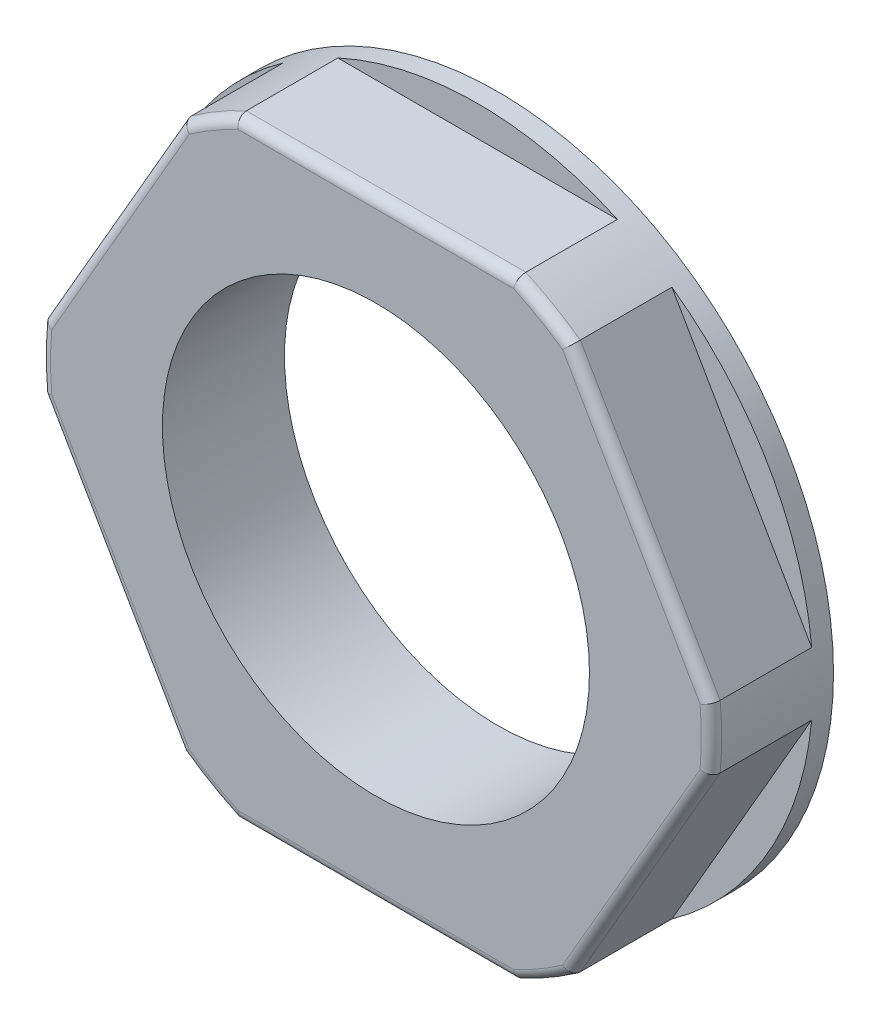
ISO-10303-21;
HEADER;
FILE_DESCRIPTION(('STEP AP214'),'2;1');
FILE_NAME('part.step','',(''),(''),'','','');
FILE_SCHEMA(('AUTOMOTIVE_DESIGN { 1 0 10303 214 1 1 1 1 }'));
ENDSEC;
DATA;
#1=APPLICATION_CONTEXT('core data for automotive mechanical design processes');
#2=APPLICATION_PROTOCOL_DEFINITION('international standard','automotive_design',2000,#1);
#3=PRODUCT_CONTEXT('',#1,'mechanical');
#4=PRODUCT('Part','Part','',(#3));
#5=PRODUCT_RELATED_PRODUCT_CATEGORY('part','',(#4));
#6=PRODUCT_DEFINITION_FORMATION('','',#4);
#7=PRODUCT_DEFINITION_CONTEXT('part definition',#1,'design');
#8=PRODUCT_DEFINITION('design','',#6,#7);
#9=PRODUCT_DEFINITION_SHAPE('','',#8);
#10=(LENGTH_UNIT() NAMED_UNIT(*) SI_UNIT(.MILLI.,.METRE.));
#11=(NAMED_UNIT(*) PLANE_ANGLE_UNIT() SI_UNIT($,.RADIAN.));
#12=(NAMED_UNIT(*) SI_UNIT($,.STERADIAN.) SOLID_ANGLE_UNIT());
#13=UNCERTAINTY_MEASURE_WITH_UNIT(LENGTH_MEASURE(1.E-05),#10,'distance_accuracy_value','');
#14=(GEOMETRIC_REPRESENTATION_CONTEXT(3) GLOBAL_UNCERTAINTY_ASSIGNED_CONTEXT((#13)) GLOBAL_UNIT_ASSIGNED_CONTEXT((#10,
#11,#12)) REPRESENTATION_CONTEXT('',''));
#15=CARTESIAN_POINT('',(0.,0.,0.));
#16=DIRECTION('',(0.,0.,1.));
#17=DIRECTION('',(1.,0.,0.));
#18=AXIS2_PLACEMENT_3D('',#15,#16,#17);
#19=CARTESIAN_POINT('',(0.,0.,6.00000000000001));
#20=DIRECTION('',(0.,0.,1.));
#21=DIRECTION('',(1.,0.,0.));
#22=AXIS2_PLACEMENT_3D('',#19,#20,#21);
#23=PLANE('',#22);
#24=DIRECTION('',(0.5,0.866025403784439,0.));
#25=VECTOR('',#24,1.);
#26=CARTESIAN_POINT('',(12.5573683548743,-7.24999999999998,6.00000000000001));
#27=LINE('',#26,#25);
#28=CARTESIAN_POINT('',(9.17543104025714,-13.10768725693,6.00000000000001));
#29=VERTEX_POINT('',#28);
#30=CARTESIAN_POINT('',(15.9393056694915,-1.39231274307,6.00000000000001));
#31=VERTEX_POINT('',#30);
#32=EDGE_CURVE('E242',#29,#31,#27,.T.);
#33=ORIENTED_EDGE('',*,*,#32,.T.);
#34=CARTESIAN_POINT('',(0.,0.,6.00000000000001));
#35=DIRECTION('',(0.,0.,1.));
#36=DIRECTION('',(1.,0.,0.));
#37=AXIS2_PLACEMENT_3D('',#34,#35,#36);
#38=CIRCLE('',#37,16.);
#39=CARTESIAN_POINT('',(15.9393056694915,1.39231274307,6.00000000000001));
#40=VERTEX_POINT('',#39);
#41=EDGE_CURVE('E244',#31,#40,#38,.T.);
#42=ORIENTED_EDGE('',*,*,#41,.T.);
#43=DIRECTION('',(-0.5,0.866025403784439,0.));
#44=VECTOR('',#43,1.);
#45=CARTESIAN_POINT('',(12.5573683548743,7.24999999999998,6.00000000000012));
#46=LINE('',#45,#44);
#47=CARTESIAN_POINT('',(9.17543104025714,13.10768725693,6.00000000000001));
#48=VERTEX_POINT('',#47);
#49=EDGE_CURVE('E222',#40,#48,#46,.T.);
#50=ORIENTED_EDGE('',*,*,#49,.T.);
#51=CARTESIAN_POINT('',(0.,0.,6.00000000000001));
#52=DIRECTION('',(0.,0.,1.));
#53=DIRECTION('',(1.,0.,0.));
#54=AXIS2_PLACEMENT_3D('',#51,#52,#53);
#55=CIRCLE('',#54,16.);
#56=CARTESIAN_POINT('',(6.76387462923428,14.5,6.00000000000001));
#57=VERTEX_POINT('',#56);
#58=EDGE_CURVE('E224',#48,#57,#55,.T.);
#59=ORIENTED_EDGE('',*,*,#58,.T.);
#60=DIRECTION('',(-1.,0.,0.));
#61=VECTOR('',#60,1.);
#62=CARTESIAN_POINT('',(0.,14.5,6.00000000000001));
#63=LINE('',#62,#61);
#64=CARTESIAN_POINT('',(-6.76387462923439,14.5,6.00000000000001));
#65=VERTEX_POINT('',#64);
#66=EDGE_CURVE('E226',#57,#65,#63,.T.);
#67=ORIENTED_EDGE('',*,*,#66,.T.);
#68=CARTESIAN_POINT('',(0.,0.,6.00000000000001));
#69=DIRECTION('',(0.,0.,1.));
#70=DIRECTION('',(1.,0.,0.));
#71=AXIS2_PLACEMENT_3D('',#68,#69,#70);
#72=CIRCLE('',#71,16.);
#73=CARTESIAN_POINT('',(-9.1754310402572,13.10768725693,6.00000000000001));
#74=VERTEX_POINT('',#73);
#75=EDGE_CURVE('E228',#65,#74,#72,.T.);
#76=ORIENTED_EDGE('',*,*,#75,.T.);
#77=DIRECTION('',(-0.5,-0.866025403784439,0.));
#78=VECTOR('',#77,1.);
#79=CARTESIAN_POINT('',(-12.5573683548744,7.24999999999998,6.00000000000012));
#80=LINE('',#79,#78);
#81=CARTESIAN_POINT('',(-15.9393056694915,1.39231274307,6.00000000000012));
#82=VERTEX_POINT('',#81);
#83=EDGE_CURVE('E230',#74,#82,#80,.T.);
#84=ORIENTED_EDGE('',*,*,#83,.T.);
#85=CARTESIAN_POINT('',(0.,0.,6.00000000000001));
#86=DIRECTION('',(0.,0.,1.));
#87=DIRECTION('',(1.,0.,0.));
#88=AXIS2_PLACEMENT_3D('',#85,#86,#87);
#89=CIRCLE('',#88,16.);
#90=CARTESIAN_POINT('',(-15.9393056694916,-1.39231274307,6.00000000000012));
#91=VERTEX_POINT('',#90);
#92=EDGE_CURVE('E232',#82,#91,#89,.T.);
#93=ORIENTED_EDGE('',*,*,#92,.T.);
#94=DIRECTION('',(0.5,-0.866025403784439,0.));
#95=VECTOR('',#94,1.);
#96=CARTESIAN_POINT('',(-12.5573683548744,-7.24999999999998,6.00000000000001));
#97=LINE('',#96,#95);
#98=CARTESIAN_POINT('',(-9.1754310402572,-13.10768725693,6.00000000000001));
#99=VERTEX_POINT('',#98);
#100=EDGE_CURVE('E234',#91,#99,#97,.T.);
#101=ORIENTED_EDGE('',*,*,#100,.T.);
#102=CARTESIAN_POINT('',(0.,0.,6.00000000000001));
#103=DIRECTION('',(0.,0.,1.));
#104=DIRECTION('',(1.,0.,0.));
#105=AXIS2_PLACEMENT_3D('',#102,#103,#104);
#106=CIRCLE('',#105,16.);
#107=CARTESIAN_POINT('',(-6.76387462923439,-14.5,6.00000000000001));
#108=VERTEX_POINT('',#107);
#109=EDGE_CURVE('E236',#99,#108,#106,.T.);
#110=ORIENTED_EDGE('',*,*,#109,.T.);
#111=DIRECTION('',(1.,0.,0.));
#112=VECTOR('',#111,1.);
#113=CARTESIAN_POINT('',(0.,-14.5,6.00000000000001));
#114=LINE('',#113,#112);
#115=CARTESIAN_POINT('',(6.76387462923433,-14.5,6.00000000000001));
#116=VERTEX_POINT('',#115);
#117=EDGE_CURVE('E238',#108,#116,#114,.T.);
#118=ORIENTED_EDGE('',*,*,#117,.T.);
#119=CARTESIAN_POINT('',(0.,0.,6.00000000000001));
#120=DIRECTION('',(0.,0.,1.));
#121=DIRECTION('',(1.,0.,0.));
#122=AXIS2_PLACEMENT_3D('',#119,#120,#121);
#123=CIRCLE('',#122,16.);
#124=EDGE_CURVE('E240',#116,#29,#123,.T.);
#125=ORIENTED_EDGE('',*,*,#124,.T.);
#126=EDGE_LOOP('',(#33,#42,#50,#59,#67,#76,#84,#93,#101,#110,#118,#125));
#127=FACE_BOUND('',#126,.T.);
#128=CARTESIAN_POINT('',(0.,0.,6.00000000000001));
#129=DIRECTION('',(0.,0.,1.));
#130=DIRECTION('',(1.,0.,0.));
#131=AXIS2_PLACEMENT_3D('',#128,#129,#130);
#132=CIRCLE('',#131,10.5);
#133=CARTESIAN_POINT('',(10.5,0.,6.));
#134=VERTEX_POINT('',#133);
#135=EDGE_CURVE('E461',#134,#134,#132,.T.);
#136=ORIENTED_EDGE('',*,*,#135,.F.);
#137=EDGE_LOOP('',(#136));
#138=FACE_BOUND('',#137,.T.);
#139=ADVANCED_FACE('F28',(#127,#138),#23,.T.);
#140=CARTESIAN_POINT('',(0.,0.,6.00000000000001));
#141=DIRECTION('',(0.,0.,-1.));
#142=DIRECTION('',(-1.,0.,0.));
#143=AXIS2_PLACEMENT_3D('',#140,#141,#142);
#144=CYLINDRICAL_SURFACE('',#143,16.5);
#145=CARTESIAN_POINT('',(0.,0.,0.));
#146=DIRECTION('',(0.,0.,1.));
#147=DIRECTION('',(1.,0.,0.));
#148=AXIS2_PLACEMENT_3D('',#145,#146,#147);
#149=CIRCLE('',#148,16.5);
#150=CARTESIAN_POINT('',(16.5,0.,0.));
#151=VERTEX_POINT('',#150);
#152=EDGE_CURVE('E171',#151,#151,#149,.T.);
#153=ORIENTED_EDGE('',*,*,#152,.T.);
#154=EDGE_LOOP('',(#153));
#155=FACE_BOUND('',#154,.T.);
#156=DIRECTION('',(0.,0.,-1.));
#157=VECTOR('',#156,1.);
#158=CARTESIAN_POINT('',(16.4273128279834,1.54705955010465,6.00000000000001));
#159=LINE('',#158,#157);
#160=CARTESIAN_POINT('',(16.4273128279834,1.54705955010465,5.49999999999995));
#161=VERTEX_POINT('',#160);
#162=CARTESIAN_POINT('',(16.4273128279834,1.54705955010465,1.));
#163=VERTEX_POINT('',#162);
#164=EDGE_CURVE('E174',#161,#163,#159,.T.);
#165=ORIENTED_EDGE('',*,*,#164,.F.);
#166=CARTESIAN_POINT('',(0.,0.,5.49999999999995));
#167=DIRECTION('',(0.,0.,1.));
#168=DIRECTION('',(1.,0.,0.));
#169=AXIS2_PLACEMENT_3D('',#166,#167,#168);
#170=CIRCLE('',#169,16.5);
#171=CARTESIAN_POINT('',(16.4273128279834,-1.54705955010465,5.49999999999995));
#172=VERTEX_POINT('',#171);
#173=EDGE_CURVE('E256',#161,#172,#170,.F.);
#174=ORIENTED_EDGE('',*,*,#173,.T.);
#175=DIRECTION('',(0.,0.,-1.));
#176=VECTOR('',#175,1.);
#177=CARTESIAN_POINT('',(16.4273128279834,-1.54705955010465,6.00000000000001));
#178=LINE('',#177,#176);
#179=CARTESIAN_POINT('',(16.4273128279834,-1.54705955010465,1.));
#180=VERTEX_POINT('',#179);
#181=EDGE_CURVE('E205',#180,#172,#178,.F.);
#182=ORIENTED_EDGE('',*,*,#181,.F.);
#183=CARTESIAN_POINT('',(0.,0.,1.));
#184=DIRECTION('',(0.,0.,1.));
#185=DIRECTION('',(1.,0.,0.));
#186=AXIS2_PLACEMENT_3D('',#183,#184,#185);
#187=CIRCLE('',#186,16.5);
#188=CARTESIAN_POINT('',(9.55344928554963,-13.4529404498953,1.));
#189=VERTEX_POINT('',#188);
#190=EDGE_CURVE('E176',#189,#180,#187,.T.);
#191=ORIENTED_EDGE('',*,*,#190,.F.);
#192=DIRECTION('',(0.,0.,-1.));
#193=VECTOR('',#192,1.);
#194=CARTESIAN_POINT('',(9.55344928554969,-13.4529404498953,6.00000000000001));
#195=LINE('',#194,#193);
#196=CARTESIAN_POINT('',(9.55344928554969,-13.4529404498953,5.50000000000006));
#197=VERTEX_POINT('',#196);
#198=EDGE_CURVE('E210',#197,#189,#195,.T.);
#199=ORIENTED_EDGE('',*,*,#198,.F.);
#200=CARTESIAN_POINT('',(0.,0.,5.49999999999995));
#201=DIRECTION('',(0.,0.,1.));
#202=DIRECTION('',(1.,0.,0.));
#203=AXIS2_PLACEMENT_3D('',#200,#201,#202);
#204=CIRCLE('',#203,16.5);
#205=CARTESIAN_POINT('',(6.87386354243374,-15.,5.50000000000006));
#206=VERTEX_POINT('',#205);
#207=EDGE_CURVE('E254',#197,#206,#204,.F.);
#208=ORIENTED_EDGE('',*,*,#207,.T.);
#209=DIRECTION('',(0.,0.,-1.));
#210=VECTOR('',#209,1.);
#211=CARTESIAN_POINT('',(6.87386354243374,-15.,6.00000000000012));
#212=LINE('',#211,#210);
#213=CARTESIAN_POINT('',(6.87386354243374,-15.,1.00000000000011));
#214=VERTEX_POINT('',#213);
#215=EDGE_CURVE('E195',#214,#206,#212,.F.);
#216=ORIENTED_EDGE('',*,*,#215,.F.);
#217=CARTESIAN_POINT('',(-6.8738635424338,-15.,1.));
#218=VERTEX_POINT('',#217);
#219=EDGE_CURVE('E190',#218,#214,#187,.T.);
#220=ORIENTED_EDGE('',*,*,#219,.F.);
#221=DIRECTION('',(0.,0.,-1.));
#222=VECTOR('',#221,1.);
#223=CARTESIAN_POINT('',(-6.8738635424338,-15.,6.00000000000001));
#224=LINE('',#223,#222);
#225=CARTESIAN_POINT('',(-6.8738635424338,-15.,5.50000000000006));
#226=VERTEX_POINT('',#225);
#227=EDGE_CURVE('E200',#226,#218,#224,.T.);
#228=ORIENTED_EDGE('',*,*,#227,.F.);
#229=CARTESIAN_POINT('',(0.,0.,5.49999999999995));
#230=DIRECTION('',(0.,0.,1.));
#231=DIRECTION('',(1.,0.,0.));
#232=AXIS2_PLACEMENT_3D('',#229,#230,#231);
#233=CIRCLE('',#232,16.5);
#234=CARTESIAN_POINT('',(-9.55344928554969,-13.4529404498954,5.50000000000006));
#235=VERTEX_POINT('',#234);
#236=EDGE_CURVE('E252',#226,#235,#233,.F.);
#237=ORIENTED_EDGE('',*,*,#236,.T.);
#238=DIRECTION('',(0.,0.,-1.));
#239=VECTOR('',#238,1.);
#240=CARTESIAN_POINT('',(-9.55344928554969,-13.4529404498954,6.00000000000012));
#241=LINE('',#240,#239);
#242=CARTESIAN_POINT('',(-9.55344928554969,-13.4529404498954,1.00000000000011));
#243=VERTEX_POINT('',#242);
#244=EDGE_CURVE('E184',#243,#235,#241,.F.);
#245=ORIENTED_EDGE('',*,*,#244,.F.);
#246=CARTESIAN_POINT('',(-16.4273128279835,-1.54705955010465,1.));
#247=VERTEX_POINT('',#246);
#248=EDGE_CURVE('E179',#247,#243,#187,.T.);
#249=ORIENTED_EDGE('',*,*,#248,.F.);
#250=DIRECTION('',(0.,0.,-1.));
#251=VECTOR('',#250,1.);
#252=CARTESIAN_POINT('',(-16.4273128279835,-1.54705955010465,6.00000000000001));
#253=LINE('',#252,#251);
#254=CARTESIAN_POINT('',(-16.4273128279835,-1.54705955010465,5.49999999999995));
#255=VERTEX_POINT('',#254);
#256=EDGE_CURVE('E189',#255,#247,#253,.T.);
#257=ORIENTED_EDGE('',*,*,#256,.F.);
#258=CARTESIAN_POINT('',(0.,0.,5.49999999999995));
#259=DIRECTION('',(0.,0.,1.));
#260=DIRECTION('',(1.,0.,0.));
#261=AXIS2_PLACEMENT_3D('',#258,#259,#260);
#262=CIRCLE('',#261,16.5);
#263=CARTESIAN_POINT('',(-16.4273128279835,1.54705955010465,5.49999999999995));
#264=VERTEX_POINT('',#263);
#265=EDGE_CURVE('E250',#255,#264,#262,.F.);
#266=ORIENTED_EDGE('',*,*,#265,.T.);
#267=DIRECTION('',(0.,0.,-1.));
#268=VECTOR('',#267,1.);
#269=CARTESIAN_POINT('',(-16.4273128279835,1.54705955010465,6.00000000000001));
#270=LINE('',#269,#268);
#271=CARTESIAN_POINT('',(-16.4273128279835,1.54705955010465,1.));
#272=VERTEX_POINT('',#271);
#273=EDGE_CURVE('E157',#272,#264,#270,.F.);
#274=ORIENTED_EDGE('',*,*,#273,.F.);
#275=CARTESIAN_POINT('',(-9.55344928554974,13.4529404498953,1.));
#276=VERTEX_POINT('',#275);
#277=EDGE_CURVE('E170',#276,#272,#187,.T.);
#278=ORIENTED_EDGE('',*,*,#277,.F.);
#279=DIRECTION('',(0.,0.,-1.));
#280=VECTOR('',#279,1.);
#281=CARTESIAN_POINT('',(-9.55344928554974,13.4529404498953,6.00000000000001));
#282=LINE('',#281,#280);
#283=CARTESIAN_POINT('',(-9.55344928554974,13.4529404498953,5.49999999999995));
#284=VERTEX_POINT('',#283);
#285=EDGE_CURVE('E178',#284,#276,#282,.T.);
#286=ORIENTED_EDGE('',*,*,#285,.F.);
#287=CARTESIAN_POINT('',(0.,0.,5.49999999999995));
#288=DIRECTION('',(0.,0.,1.));
#289=DIRECTION('',(1.,0.,0.));
#290=AXIS2_PLACEMENT_3D('',#287,#288,#289);
#291=CIRCLE('',#290,16.5);
#292=CARTESIAN_POINT('',(-6.8738635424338,15.,5.50000000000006));
#293=VERTEX_POINT('',#292);
#294=EDGE_CURVE('E248',#284,#293,#291,.F.);
#295=ORIENTED_EDGE('',*,*,#294,.T.);
#296=DIRECTION('',(0.,0.,-1.));
#297=VECTOR('',#296,1.);
#298=CARTESIAN_POINT('',(-6.8738635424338,15.,6.00000000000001));
#299=LINE('',#298,#297);
#300=CARTESIAN_POINT('',(-6.8738635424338,15.,1.));
#301=VERTEX_POINT('',#300);
#302=EDGE_CURVE('E167',#301,#293,#299,.F.);
#303=ORIENTED_EDGE('',*,*,#302,.F.);
#304=CARTESIAN_POINT('',(6.87386354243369,15.,1.));
#305=VERTEX_POINT('',#304);
#306=EDGE_CURVE('E158',#305,#301,#187,.T.);
#307=ORIENTED_EDGE('',*,*,#306,.F.);
#308=DIRECTION('',(0.,0.,-1.));
#309=VECTOR('',#308,1.);
#310=CARTESIAN_POINT('',(6.87386354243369,15.,6.00000000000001));
#311=LINE('',#310,#309);
#312=CARTESIAN_POINT('',(6.87386354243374,15.,5.49999999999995));
#313=VERTEX_POINT('',#312);
#314=EDGE_CURVE('E150',#313,#305,#311,.T.);
#315=ORIENTED_EDGE('',*,*,#314,.F.);
#316=CARTESIAN_POINT('',(0.,0.,5.49999999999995));
#317=DIRECTION('',(0.,0.,1.));
#318=DIRECTION('',(1.,0.,0.));
#319=AXIS2_PLACEMENT_3D('',#316,#317,#318);
#320=CIRCLE('',#319,16.5);
#321=CARTESIAN_POINT('',(9.55344928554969,13.4529404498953,5.50000000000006));
#322=VERTEX_POINT('',#321);
#323=EDGE_CURVE('E43',#313,#322,#320,.F.);
#324=ORIENTED_EDGE('',*,*,#323,.T.);
#325=DIRECTION('',(0.,0.,-1.));
#326=VECTOR('',#325,1.);
#327=CARTESIAN_POINT('',(9.55344928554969,13.4529404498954,6.00000000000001));
#328=LINE('',#327,#326);
#329=CARTESIAN_POINT('',(9.55344928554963,13.4529404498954,1.));
#330=VERTEX_POINT('',#329);
#331=EDGE_CURVE('E175',#330,#322,#328,.F.);
#332=ORIENTED_EDGE('',*,*,#331,.F.);
#333=EDGE_CURVE('E169',#163,#330,#187,.T.);
#334=ORIENTED_EDGE('',*,*,#333,.F.);
#335=EDGE_LOOP('',(#165,#174,#182,#191,#199,#208,#216,#220,#228,#237,#245,#249,#257,#266,#274,
#278,#286,#295,#303,#307,#315,#324,#332,#334));
#336=FACE_BOUND('',#335,.T.);
#337=ADVANCED_FACE('F30',(#155,#336),#144,.T.);
#338=CARTESIAN_POINT('',(0.,0.,0.));
#339=DIRECTION('',(0.,0.,1.));
#340=DIRECTION('',(1.,0.,0.));
#341=AXIS2_PLACEMENT_3D('',#338,#339,#340);
#342=PLANE('',#341);
#343=ORIENTED_EDGE('',*,*,#152,.F.);
#344=EDGE_LOOP('',(#343));
#345=FACE_BOUND('',#344,.T.);
#346=CARTESIAN_POINT('',(0.,0.,0.));
#347=DIRECTION('',(0.,0.,1.));
#348=DIRECTION('',(1.,0.,0.));
#349=AXIS2_PLACEMENT_3D('',#346,#347,#348);
#350=CIRCLE('',#349,10.5);
#351=CARTESIAN_POINT('',(10.5,0.,0.));
#352=VERTEX_POINT('',#351);
#353=EDGE_CURVE('E458',#352,#352,#350,.T.);
#354=ORIENTED_EDGE('',*,*,#353,.T.);
#355=EDGE_LOOP('',(#354));
#356=FACE_BOUND('',#355,.T.);
#357=ADVANCED_FACE('F393',(#345,#356),#342,.F.);
#358=CARTESIAN_POINT('',(0.,0.,6.00000000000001));
#359=DIRECTION('',(0.,0.,-1.));
#360=DIRECTION('',(-1.,0.,0.));
#361=AXIS2_PLACEMENT_3D('',#358,#359,#360);
#362=CYLINDRICAL_SURFACE('',#361,10.5);
#363=ORIENTED_EDGE('',*,*,#135,.T.);
#364=EDGE_LOOP('',(#363));
#365=FACE_BOUND('',#364,.T.);
#366=ORIENTED_EDGE('',*,*,#353,.F.);
#367=EDGE_LOOP('',(#366));
#368=FACE_BOUND('',#367,.T.);
#369=ADVANCED_FACE('F399',(#365,#368),#362,.F.);
#370=CARTESIAN_POINT('',(8.66025403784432,15.,1.));
#371=DIRECTION('',(0.,1.,0.));
#372=DIRECTION('',(-1.,0.,0.));
#373=AXIS2_PLACEMENT_3D('',#370,#371,#372);
#374=PLANE('',#373);
#375=ORIENTED_EDGE('',*,*,#302,.T.);
#376=DIRECTION('',(-1.,0.,0.));
#377=VECTOR('',#376,1.);
#378=CARTESIAN_POINT('',(8.66025403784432,15.,5.50000000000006));
#379=LINE('',#378,#377);
#380=EDGE_CURVE('E36',#293,#313,#379,.F.);
#381=ORIENTED_EDGE('',*,*,#380,.T.);
#382=ORIENTED_EDGE('',*,*,#314,.T.);
#383=DIRECTION('',(-1.,0.,0.));
#384=VECTOR('',#383,1.);
#385=CARTESIAN_POINT('',(8.66025403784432,15.,1.));
#386=LINE('',#385,#384);
#387=EDGE_CURVE('E153',#305,#301,#386,.T.);
#388=ORIENTED_EDGE('',*,*,#387,.T.);
#389=EDGE_LOOP('',(#375,#381,#382,#388));
#390=FACE_BOUND('',#389,.T.);
#391=ADVANCED_FACE('F152',(#390),#374,.T.);
#392=CARTESIAN_POINT('',(0.,0.,1.));
#393=DIRECTION('',(0.,0.,1.));
#394=DIRECTION('',(1.,0.,0.));
#395=AXIS2_PLACEMENT_3D('',#392,#393,#394);
#396=PLANE('',#395);
#397=ORIENTED_EDGE('',*,*,#306,.T.);
#398=ORIENTED_EDGE('',*,*,#387,.F.);
#399=EDGE_LOOP('',(#397,#398));
#400=FACE_BOUND('',#399,.T.);
#401=ADVANCED_FACE('F161',(#400),#396,.T.);
#402=CARTESIAN_POINT('',(-8.66025403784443,15.,1.));
#403=DIRECTION('',(-0.866025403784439,0.5,0.));
#404=DIRECTION('',(-0.5,-0.866025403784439,0.));
#405=AXIS2_PLACEMENT_3D('',#402,#403,#404);
#406=PLANE('',#405);
#407=ORIENTED_EDGE('',*,*,#273,.T.);
#408=DIRECTION('',(-0.5,-0.866025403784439,0.));
#409=VECTOR('',#408,1.);
#410=CARTESIAN_POINT('',(-8.66025403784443,15.,5.50000000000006));
#411=LINE('',#410,#409);
#412=EDGE_CURVE('E265',#264,#284,#411,.F.);
#413=ORIENTED_EDGE('',*,*,#412,.T.);
#414=ORIENTED_EDGE('',*,*,#285,.T.);
#415=DIRECTION('',(-0.5,-0.866025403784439,0.));
#416=VECTOR('',#415,1.);
#417=CARTESIAN_POINT('',(-8.66025403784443,15.,1.));
#418=LINE('',#417,#416);
#419=EDGE_CURVE('E163',#276,#272,#418,.T.);
#420=ORIENTED_EDGE('',*,*,#419,.T.);
#421=EDGE_LOOP('',(#407,#413,#414,#420));
#422=FACE_BOUND('',#421,.T.);
#423=ADVANCED_FACE('F269',(#422),#406,.T.);
#424=ORIENTED_EDGE('',*,*,#277,.T.);
#425=ORIENTED_EDGE('',*,*,#419,.F.);
#426=EDGE_LOOP('',(#424,#425));
#427=FACE_BOUND('',#426,.T.);
#428=ADVANCED_FACE('F416',(#427),#396,.T.);
#429=CARTESIAN_POINT('',(-17.3205080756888,0.,1.));
#430=DIRECTION('',(-0.866025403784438,-0.5,0.));
#431=DIRECTION('',(0.5,-0.866025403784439,0.));
#432=AXIS2_PLACEMENT_3D('',#429,#430,#431);
#433=PLANE('',#432);
#434=ORIENTED_EDGE('',*,*,#244,.T.);
#435=DIRECTION('',(0.5,-0.866025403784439,0.));
#436=VECTOR('',#435,1.);
#437=CARTESIAN_POINT('',(-17.3205080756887,0.,5.49999999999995));
#438=LINE('',#437,#436);
#439=EDGE_CURVE('E263',#235,#255,#438,.F.);
#440=ORIENTED_EDGE('',*,*,#439,.T.);
#441=ORIENTED_EDGE('',*,*,#256,.T.);
#442=DIRECTION('',(0.5,-0.866025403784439,0.));
#443=VECTOR('',#442,1.);
#444=CARTESIAN_POINT('',(-17.3205080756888,0.,1.));
#445=LINE('',#444,#443);
#446=EDGE_CURVE('E452',#247,#243,#445,.T.);
#447=ORIENTED_EDGE('',*,*,#446,.T.);
#448=EDGE_LOOP('',(#434,#440,#441,#447));
#449=FACE_BOUND('',#448,.T.);
#450=ADVANCED_FACE('F417',(#449),#433,.T.);
#451=ORIENTED_EDGE('',*,*,#248,.T.);
#452=ORIENTED_EDGE('',*,*,#446,.F.);
#453=EDGE_LOOP('',(#451,#452));
#454=FACE_BOUND('',#453,.T.);
#455=ADVANCED_FACE('F420',(#454),#396,.T.);
#456=CARTESIAN_POINT('',(-8.66025403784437,-15.,1.));
#457=DIRECTION('',(0.,-1.,0.));
#458=DIRECTION('',(1.,0.,0.));
#459=AXIS2_PLACEMENT_3D('',#456,#457,#458);
#460=PLANE('',#459);
#461=ORIENTED_EDGE('',*,*,#215,.T.);
#462=DIRECTION('',(1.,0.,0.));
#463=VECTOR('',#462,1.);
#464=CARTESIAN_POINT('',(-8.66025403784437,-15.,5.49999999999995));
#465=LINE('',#464,#463);
#466=EDGE_CURVE('E261',#206,#226,#465,.F.);
#467=ORIENTED_EDGE('',*,*,#466,.T.);
#468=ORIENTED_EDGE('',*,*,#227,.T.);
#469=DIRECTION('',(1.,0.,0.));
#470=VECTOR('',#469,1.);
#471=CARTESIAN_POINT('',(-8.66025403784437,-15.,1.));
#472=LINE('',#471,#470);
#473=EDGE_CURVE('E454',#218,#214,#472,.T.);
#474=ORIENTED_EDGE('',*,*,#473,.T.);
#475=EDGE_LOOP('',(#461,#467,#468,#474));
#476=FACE_BOUND('',#475,.T.);
#477=ADVANCED_FACE('F422',(#476),#460,.T.);
#478=ORIENTED_EDGE('',*,*,#219,.T.);
#479=ORIENTED_EDGE('',*,*,#473,.F.);
#480=EDGE_LOOP('',(#478,#479));
#481=FACE_BOUND('',#480,.T.);
#482=ADVANCED_FACE('F425',(#481),#396,.T.);
#483=CARTESIAN_POINT('',(8.66025403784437,-15.,1.));
#484=DIRECTION('',(0.866025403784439,-0.5,0.));
#485=DIRECTION('',(0.5,0.866025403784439,0.));
#486=AXIS2_PLACEMENT_3D('',#483,#484,#485);
#487=PLANE('',#486);
#488=ORIENTED_EDGE('',*,*,#181,.T.);
#489=DIRECTION('',(0.5,0.866025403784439,0.));
#490=VECTOR('',#489,1.);
#491=CARTESIAN_POINT('',(8.66025403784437,-15.,5.49999999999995));
#492=LINE('',#491,#490);
#493=EDGE_CURVE('E259',#172,#197,#492,.F.);
#494=ORIENTED_EDGE('',*,*,#493,.T.);
#495=ORIENTED_EDGE('',*,*,#198,.T.);
#496=DIRECTION('',(0.5,0.866025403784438,0.));
#497=VECTOR('',#496,1.);
#498=CARTESIAN_POINT('',(8.66025403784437,-15.,1.));
#499=LINE('',#498,#497);
#500=EDGE_CURVE('E456',#189,#180,#499,.T.);
#501=ORIENTED_EDGE('',*,*,#500,.T.);
#502=EDGE_LOOP('',(#488,#494,#495,#501));
#503=FACE_BOUND('',#502,.T.);
#504=ADVANCED_FACE('F328',(#503),#487,.T.);
#505=ORIENTED_EDGE('',*,*,#190,.T.);
#506=ORIENTED_EDGE('',*,*,#500,.F.);
#507=EDGE_LOOP('',(#505,#506));
#508=FACE_BOUND('',#507,.T.);
#509=ADVANCED_FACE('F407',(#508),#396,.T.);
#510=ORIENTED_EDGE('',*,*,#333,.T.);
#511=DIRECTION('',(-0.5,0.866025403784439,0.));
#512=VECTOR('',#511,1.);
#513=CARTESIAN_POINT('',(17.3205080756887,0.,1.));
#514=LINE('',#513,#512);
#515=EDGE_CURVE('E164',#163,#330,#514,.T.);
#516=ORIENTED_EDGE('',*,*,#515,.F.);
#517=EDGE_LOOP('',(#510,#516));
#518=FACE_BOUND('',#517,.T.);
#519=ADVANCED_FACE('F404',(#518),#396,.T.);
#520=CARTESIAN_POINT('',(17.3205080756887,0.,1.));
#521=DIRECTION('',(0.866025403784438,0.5,0.));
#522=DIRECTION('',(-0.5,0.866025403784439,0.));
#523=AXIS2_PLACEMENT_3D('',#520,#521,#522);
#524=PLANE('',#523);
#525=ORIENTED_EDGE('',*,*,#331,.T.);
#526=DIRECTION('',(-0.5,0.866025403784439,0.));
#527=VECTOR('',#526,1.);
#528=CARTESIAN_POINT('',(17.3205080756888,0.,5.50000000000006));
#529=LINE('',#528,#527);
#530=EDGE_CURVE('E11',#322,#161,#529,.F.);
#531=ORIENTED_EDGE('',*,*,#530,.T.);
#532=ORIENTED_EDGE('',*,*,#164,.T.);
#533=ORIENTED_EDGE('',*,*,#515,.T.);
#534=EDGE_LOOP('',(#525,#531,#532,#533));
#535=FACE_BOUND('',#534,.T.);
#536=ADVANCED_FACE('F312',(#535),#524,.T.);
#537=CARTESIAN_POINT('',(0.,0.,5.49999999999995));
#538=DIRECTION('',(0.,0.,1.));
#539=DIRECTION('',(1.,0.,0.));
#540=AXIS2_PLACEMENT_3D('',#537,#538,#539);
#541=TOROIDAL_SURFACE('',#540,16.,0.5);
#542=CARTESIAN_POINT('',(-16.4273128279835,1.54705955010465,5.49999999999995));
#543=CARTESIAN_POINT('',(-16.4273380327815,1.54706781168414,5.52765870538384));
#544=CARTESIAN_POINT('',(-16.425076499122,1.54634627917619,5.55530651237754));
#545=CARTESIAN_POINT('',(-16.4161699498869,1.54350587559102,5.60977585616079));
#546=CARTESIAN_POINT('',(-16.4095309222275,1.54138891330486,5.63659846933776));
#547=CARTESIAN_POINT('',(-16.3920562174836,1.53581888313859,5.68869926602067));
#548=CARTESIAN_POINT('',(-16.3812194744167,1.53236547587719,5.71397705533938));
#549=CARTESIAN_POINT('',(-16.3556965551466,1.52423622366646,5.76228798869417));
#550=CARTESIAN_POINT('',(-16.3410105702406,1.51956043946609,5.78532124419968));
#551=CARTESIAN_POINT('',(-16.3080669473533,1.50907851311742,5.82875080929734));
#552=CARTESIAN_POINT('',(-16.2897755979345,1.50326170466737,5.84911895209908));
#553=CARTESIAN_POINT('',(-16.2502478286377,1.49070115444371,5.88643296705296));
#554=CARTESIAN_POINT('',(-16.229010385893,1.48395709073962,5.90337764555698));
#555=CARTESIAN_POINT('',(-16.1837014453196,1.46958130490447,5.93375449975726));
#556=CARTESIAN_POINT('',(-16.1595778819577,1.46193331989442,5.94710120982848));
#557=CARTESIAN_POINT('',(-16.1095698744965,1.44609413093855,5.96945082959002));
#558=CARTESIAN_POINT('',(-16.0836863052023,1.43790319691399,5.97845587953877));
#559=CARTESIAN_POINT('',(-16.0390480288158,1.42379127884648,5.98984029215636));
#560=CARTESIAN_POINT('',(-16.020559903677,1.41795033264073,5.99340694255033));
#561=CARTESIAN_POINT('',(-15.9833361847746,1.40619841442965,5.99833345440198));
#562=CARTESIAN_POINT('',(-15.9646010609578,1.4002875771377,5.99969702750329));
#563=CARTESIAN_POINT('',(-15.9436789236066,1.39369135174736,5.99998500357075));
#564=CARTESIAN_POINT('',(-15.941492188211,1.3930019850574,6.00000003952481));
#565=CARTESIAN_POINT('',(-15.9393056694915,1.39231274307,6.00000000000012));
#566=B_SPLINE_CURVE_WITH_KNOTS('',3,(#542,#543,#544,#545,#546,#547,#548,#549,#550,#551,#552,
#553,#554,#555,#556,#557,#558,#559,#560,#561,#562,#563,#564,#565),.UNSPECIFIED.,.F.,.F.,(4,2,2,
2,2,2,2,2,2,2,2,4),(0.,0.0828581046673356,0.165603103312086,0.248369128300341,0.331131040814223,
0.414707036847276,0.498312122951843,0.583756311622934,0.669158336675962,0.728190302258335,
0.78712270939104,0.794001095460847),.UNSPECIFIED.);
#567=EDGE_CURVE('E438',#264,#82,#566,.T.);
#568=ORIENTED_EDGE('',*,*,#567,.F.);
#569=ORIENTED_EDGE('',*,*,#265,.F.);
#570=CARTESIAN_POINT('',(-16.4273128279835,-1.54705955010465,5.49999999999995));
#571=CARTESIAN_POINT('',(-16.4273380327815,-1.54706781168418,5.52765870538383));
#572=CARTESIAN_POINT('',(-16.425076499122,-1.54634627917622,5.55530651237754));
#573=CARTESIAN_POINT('',(-16.4161699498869,-1.543505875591,5.6097758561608));
#574=CARTESIAN_POINT('',(-16.4095309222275,-1.5413889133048,5.63659846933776));
#575=CARTESIAN_POINT('',(-16.3920562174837,-1.53581888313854,5.68869926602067));
#576=CARTESIAN_POINT('',(-16.3812194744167,-1.53236547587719,5.71397705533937));
#577=CARTESIAN_POINT('',(-16.3556965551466,-1.52423622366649,5.76228798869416));
#578=CARTESIAN_POINT('',(-16.3410105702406,-1.51956043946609,5.78532124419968));
#579=CARTESIAN_POINT('',(-16.3080669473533,-1.50907851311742,5.82875080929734));
#580=CARTESIAN_POINT('',(-16.2897755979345,-1.50326170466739,5.84911895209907));
#581=CARTESIAN_POINT('',(-16.2502478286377,-1.49070115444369,5.88643296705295));
#582=CARTESIAN_POINT('',(-16.229010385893,-1.48395709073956,5.90337764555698));
#583=CARTESIAN_POINT('',(-16.1837014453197,-1.46958130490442,5.93375449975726));
#584=CARTESIAN_POINT('',(-16.1595778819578,-1.46193331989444,5.94710120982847));
#585=CARTESIAN_POINT('',(-16.1095698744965,-1.44609413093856,5.96945082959));
#586=CARTESIAN_POINT('',(-16.0836863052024,-1.4379031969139,5.97845587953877));
#587=CARTESIAN_POINT('',(-16.0390480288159,-1.42379127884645,5.98984029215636));
#588=CARTESIAN_POINT('',(-16.020559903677,-1.41795033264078,5.99340694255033));
#589=CARTESIAN_POINT('',(-15.9833361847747,-1.40619841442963,5.99833345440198));
#590=CARTESIAN_POINT('',(-15.9646010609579,-1.40028757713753,5.99969702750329));
#591=CARTESIAN_POINT('',(-15.9436789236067,-1.39369135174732,5.99998500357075));
#592=CARTESIAN_POINT('',(-15.9414921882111,-1.39300198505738,6.00000003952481));
#593=CARTESIAN_POINT('',(-15.9393056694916,-1.39231274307,6.00000000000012));
#594=B_SPLINE_CURVE_WITH_KNOTS('',3,(#570,#571,#572,#573,#574,#575,#576,#577,#578,#579,#580,
#581,#582,#583,#584,#585,#586,#587,#588,#589,#590,#591,#592,#593),.UNSPECIFIED.,.F.,.F.,(4,2,2,
2,2,2,2,2,2,2,2,4),(0.,0.0828581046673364,0.165603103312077,0.248369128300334,0.331131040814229,
0.41470703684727,0.49831212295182,0.583756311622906,0.669158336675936,0.728190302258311,
0.787122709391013,0.794001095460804),.UNSPECIFIED.);
#595=EDGE_CURVE('E444',#91,#255,#594,.F.);
#596=ORIENTED_EDGE('',*,*,#595,.F.);
#597=ORIENTED_EDGE('',*,*,#92,.F.);
#598=EDGE_LOOP('',(#568,#569,#596,#597));
#599=FACE_BOUND('',#598,.T.);
#600=ADVANCED_FACE('F411',(#599),#541,.T.);
#601=CARTESIAN_POINT('',(-12.5573683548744,-7.24999999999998,5.50000000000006));
#602=DIRECTION('',(0.5,-0.866025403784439,0.));
#603=DIRECTION('',(0.866025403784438,0.5,0.));
#604=AXIS2_PLACEMENT_3D('',#601,#602,#603);
#605=CYLINDRICAL_SURFACE('',#604,0.5);
#606=ORIENTED_EDGE('',*,*,#595,.T.);
#607=ORIENTED_EDGE('',*,*,#439,.F.);
#608=CARTESIAN_POINT('',(-9.55344928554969,-13.4529404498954,5.50000000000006));
#609=CARTESIAN_POINT('',(-9.55346904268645,-13.452958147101,5.52765870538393));
#610=CARTESIAN_POINT('',(-9.55171341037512,-13.4513603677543,5.55530651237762));
#611=CARTESIAN_POINT('',(-9.5448002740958,-13.4450672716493,5.60977585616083));
#612=CARTESIAN_POINT('',(-9.5396474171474,-13.4403761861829,5.63659846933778));
#613=CARTESIAN_POINT('',(-9.52608627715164,-13.4280276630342,5.68869926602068));
#614=CARTESIAN_POINT('',(-9.51767716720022,-13.4203694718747,5.71397705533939));
#615=CARTESIAN_POINT('',(-9.49787556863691,-13.4023306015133,5.76228798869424));
#616=CARTESIAN_POINT('',(-9.48648322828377,-13.3919500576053,5.78532124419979));
#617=CARTESIAN_POINT('',(-9.46093380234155,-13.3686610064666,5.82875080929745));
#618=CARTESIAN_POINT('',(-9.44675062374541,-13.3557286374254,5.84911895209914));
#619=CARTESIAN_POINT('',(-9.41610898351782,-13.3277768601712,5.88643296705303));
#620=CARTESIAN_POINT('',(-9.39964973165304,-13.312756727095,5.90337764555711));
#621=CARTESIAN_POINT('',(-9.36454546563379,-13.2807059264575,5.93375449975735));
#622=CARTESIAN_POINT('',(-9.34586033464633,-13.2636383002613,5.94710120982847));
#623=CARTESIAN_POINT('',(-9.30713919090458,-13.2282496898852,5.96945082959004));
#624=CARTESIAN_POINT('',(-9.28710384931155,-13.2099293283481,5.97845587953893));
#625=CARTESIAN_POINT('',(-9.25256343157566,-13.17832740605,5.98984029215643));
#626=CARTESIAN_POINT('',(-9.23826096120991,-13.1652366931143,5.99340694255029));
#627=CARTESIAN_POINT('',(-9.20947164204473,-13.1388759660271,5.99833345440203));
#628=CARTESIAN_POINT('',(-9.1949851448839,-13.1256062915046,5.99969702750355));
#629=CARTESIAN_POINT('',(-9.1788115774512,-13.1107853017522,5.99998500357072));
#630=CARTESIAN_POINT('',(-9.17712120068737,-13.1092362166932,6.00000003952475));
#631=CARTESIAN_POINT('',(-9.1754310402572,-13.10768725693,6.00000000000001));
#632=B_SPLINE_CURVE_WITH_KNOTS('',3,(#608,#609,#610,#611,#612,#613,#614,#615,#616,#617,#618,
#619,#620,#621,#622,#623,#624,#625,#626,#627,#628,#629,#630,#631),.UNSPECIFIED.,.F.,.F.,(4,2,2,
2,2,2,2,2,2,2,2,4),(0.,0.0828581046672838,0.165603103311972,0.248369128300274,0.331131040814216,
0.414707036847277,0.498312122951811,0.583756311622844,0.669158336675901,0.7281903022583,
0.787122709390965,0.794001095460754),.UNSPECIFIED.);
#633=EDGE_CURVE('E281',#99,#235,#632,.F.);
#634=ORIENTED_EDGE('',*,*,#633,.F.);
#635=ORIENTED_EDGE('',*,*,#100,.F.);
#636=EDGE_LOOP('',(#606,#607,#634,#635));
#637=FACE_BOUND('',#636,.T.);
#638=ADVANCED_FACE('F432',(#637),#605,.T.);
#639=CARTESIAN_POINT('',(-12.5573683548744,7.24999999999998,5.50000000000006));
#640=DIRECTION('',(-0.5,-0.866025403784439,0.));
#641=DIRECTION('',(0.866025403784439,-0.5,0.));
#642=AXIS2_PLACEMENT_3D('',#639,#640,#641);
#643=CYLINDRICAL_SURFACE('',#642,0.5);
#644=ORIENTED_EDGE('',*,*,#567,.T.);
#645=ORIENTED_EDGE('',*,*,#83,.F.);
#646=CARTESIAN_POINT('',(-9.55344928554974,13.4529404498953,5.49999999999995));
#647=CARTESIAN_POINT('',(-9.55346904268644,13.452958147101,5.52765870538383));
#648=CARTESIAN_POINT('',(-9.55171341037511,13.4513603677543,5.55530651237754));
#649=CARTESIAN_POINT('',(-9.54480027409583,13.4450672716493,5.6097758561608));
#650=CARTESIAN_POINT('',(-9.53964741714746,13.4403761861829,5.63659846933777));
#651=CARTESIAN_POINT('',(-9.5260862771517,13.4280276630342,5.68869926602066));
#652=CARTESIAN_POINT('',(-9.51767716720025,13.4203694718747,5.71397705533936));
#653=CARTESIAN_POINT('',(-9.49787556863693,13.4023306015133,5.76228798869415));
#654=CARTESIAN_POINT('',(-9.4864832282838,13.3919500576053,5.78532124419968));
#655=CARTESIAN_POINT('',(-9.46093380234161,13.3686610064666,5.82875080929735));
#656=CARTESIAN_POINT('',(-9.44675062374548,13.3557286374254,5.84911895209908));
#657=CARTESIAN_POINT('',(-9.41610898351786,13.3277768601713,5.88643296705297));
#658=CARTESIAN_POINT('',(-9.39964973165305,13.312756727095,5.90337764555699));
#659=CARTESIAN_POINT('',(-9.36454546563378,13.2807059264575,5.93375449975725));
#660=CARTESIAN_POINT('',(-9.34586033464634,13.2636383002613,5.94710120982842));
#661=CARTESIAN_POINT('',(-9.30713919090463,13.2282496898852,5.96945082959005));
#662=CARTESIAN_POINT('',(-9.28710384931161,13.2099293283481,5.97845587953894));
#663=CARTESIAN_POINT('',(-9.25256343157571,13.17832740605,5.98984029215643));
#664=CARTESIAN_POINT('',(-9.23826096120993,13.1652366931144,5.99340694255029));
#665=CARTESIAN_POINT('',(-9.20947164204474,13.1388759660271,5.99833345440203));
#666=CARTESIAN_POINT('',(-9.1949851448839,13.1256062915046,5.99969702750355));
#667=CARTESIAN_POINT('',(-9.1788115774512,13.1107853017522,5.99998500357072));
#668=CARTESIAN_POINT('',(-9.17712120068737,13.1092362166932,6.00000003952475));
#669=CARTESIAN_POINT('',(-9.1754310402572,13.10768725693,6.00000000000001));
#670=B_SPLINE_CURVE_WITH_KNOTS('',3,(#646,#647,#648,#649,#650,#651,#652,#653,#654,#655,#656,
#657,#658,#659,#660,#661,#662,#663,#664,#665,#666,#667,#668,#669),.UNSPECIFIED.,.F.,.F.,(4,2,2,
2,2,2,2,2,2,2,2,4),(0.,0.0828581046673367,0.165603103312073,0.248369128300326,0.331131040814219,
0.414707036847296,0.498312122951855,0.5837563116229,0.669158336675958,0.728190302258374,
0.787122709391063,0.794001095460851),.UNSPECIFIED.);
#671=EDGE_CURVE('E277',#284,#74,#670,.T.);
#672=ORIENTED_EDGE('',*,*,#671,.F.);
#673=ORIENTED_EDGE('',*,*,#412,.F.);
#674=EDGE_LOOP('',(#644,#645,#672,#673));
#675=FACE_BOUND('',#674,.T.);
#676=ADVANCED_FACE('F278',(#675),#643,.T.);
#677=CARTESIAN_POINT('',(0.,0.,5.49999999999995));
#678=DIRECTION('',(0.,0.,1.));
#679=DIRECTION('',(1.,0.,0.));
#680=AXIS2_PLACEMENT_3D('',#677,#678,#679);
#681=TOROIDAL_SURFACE('',#680,16.,0.5);
#682=ORIENTED_EDGE('',*,*,#633,.T.);
#683=ORIENTED_EDGE('',*,*,#236,.F.);
#684=CARTESIAN_POINT('',(-6.8738635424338,-15.,5.50000000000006));
#685=CARTESIAN_POINT('',(-6.87386899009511,-15.0000259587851,5.52765870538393));
#686=CARTESIAN_POINT('',(-6.87336308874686,-14.9977066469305,5.55530651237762));
#687=CARTESIAN_POINT('',(-6.87136967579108,-14.9885731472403,5.60977585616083));
#688=CARTESIAN_POINT('',(-6.86988350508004,-14.9817650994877,5.63659846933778));
#689=CARTESIAN_POINT('',(-6.86596994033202,-14.9638465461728,5.68869926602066));
#690=CARTESIAN_POINT('',(-6.86354230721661,-14.9527349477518,5.71397705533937));
#691=CARTESIAN_POINT('',(-6.85782098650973,-14.9265668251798,5.76228798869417));
#692=CARTESIAN_POINT('',(-6.85452734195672,-14.9115104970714,5.78532124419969));
#693=CARTESIAN_POINT('',(-6.84713314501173,-14.877739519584,5.82875080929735));
#694=CARTESIAN_POINT('',(-6.84302497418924,-14.8589903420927,5.84911895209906));
#695=CARTESIAN_POINT('',(-6.83413884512,-14.8184780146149,5.886432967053));
#696=CARTESIAN_POINT('',(-6.82936065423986,-14.7967138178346,5.9033776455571));
#697=CARTESIAN_POINT('',(-6.81915597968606,-14.7502872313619,5.93375449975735));
#698=CARTESIAN_POINT('',(-6.81371754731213,-14.7255716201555,5.94710120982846));
#699=CARTESIAN_POINT('',(-6.80243068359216,-14.6743438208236,5.96945082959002));
#700=CARTESIAN_POINT('',(-6.79658245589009,-14.6478325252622,5.97845587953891));
#701=CARTESIAN_POINT('',(-6.78648459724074,-14.6021186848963,5.98984029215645));
#702=CARTESIAN_POINT('',(-6.78229894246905,-14.5831870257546,5.99340694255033));
#703=CARTESIAN_POINT('',(-6.77386454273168,-14.5450743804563,5.99833345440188));
#704=CARTESIAN_POINT('',(-6.76961591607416,-14.5258938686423,5.99969702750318));
#705=CARTESIAN_POINT('',(-6.76486734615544,-14.5044766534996,5.99998500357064));
#706=CARTESIAN_POINT('',(-6.76437098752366,-14.5022382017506,6.0000000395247));
#707=CARTESIAN_POINT('',(-6.76387462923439,-14.5,6.00000000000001));
#708=B_SPLINE_CURVE_WITH_KNOTS('',3,(#684,#685,#686,#687,#688,#689,#690,#691,#692,#693,#694,
#695,#696,#697,#698,#699,#700,#701,#702,#703,#704,#705,#706,#707),.UNSPECIFIED.,.F.,.F.,(4,2,2,
2,2,2,2,2,2,2,2,4),(0.,0.0828581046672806,0.165603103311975,0.248369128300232,0.331131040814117,
0.414707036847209,0.498312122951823,0.583756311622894,0.669158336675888,0.72819030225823,
0.787122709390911,0.794001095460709),.UNSPECIFIED.);
#709=EDGE_CURVE('E282',#108,#226,#708,.F.);
#710=ORIENTED_EDGE('',*,*,#709,.F.);
#711=ORIENTED_EDGE('',*,*,#109,.F.);
#712=EDGE_LOOP('',(#682,#683,#710,#711));
#713=FACE_BOUND('',#712,.T.);
#714=ADVANCED_FACE('F512',(#713),#681,.T.);
#715=CARTESIAN_POINT('',(0.,0.,5.49999999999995));
#716=DIRECTION('',(0.,0.,1.));
#717=DIRECTION('',(1.,0.,0.));
#718=AXIS2_PLACEMENT_3D('',#715,#716,#717);
#719=TOROIDAL_SURFACE('',#718,16.,0.5);
#720=ORIENTED_EDGE('',*,*,#671,.T.);
#721=ORIENTED_EDGE('',*,*,#75,.F.);
#722=CARTESIAN_POINT('',(-6.8738635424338,15.,5.50000000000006));
#723=CARTESIAN_POINT('',(-6.87386899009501,15.0000259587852,5.52765870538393));
#724=CARTESIAN_POINT('',(-6.87336308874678,14.9977066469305,5.55530651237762));
#725=CARTESIAN_POINT('',(-6.87136967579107,14.9885731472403,5.60977585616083));
#726=CARTESIAN_POINT('',(-6.86988350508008,14.9817650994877,5.63659846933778));
#727=CARTESIAN_POINT('',(-6.86596994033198,14.9638465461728,5.68869926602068));
#728=CARTESIAN_POINT('',(-6.86354230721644,14.9527349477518,5.7139770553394));
#729=CARTESIAN_POINT('',(-6.85782098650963,14.9265668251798,5.76228798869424));
#730=CARTESIAN_POINT('',(-6.85452734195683,14.9115104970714,5.78532124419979));
#731=CARTESIAN_POINT('',(-6.84713314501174,14.877739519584,5.82875080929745));
#732=CARTESIAN_POINT('',(-6.84302497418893,14.8589903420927,5.84911895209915));
#733=CARTESIAN_POINT('',(-6.83413884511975,14.8184780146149,5.88643296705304));
#734=CARTESIAN_POINT('',(-6.82936065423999,14.7967138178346,5.9033776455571));
#735=CARTESIAN_POINT('',(-6.81915597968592,14.7502872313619,5.93375449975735));
#736=CARTESIAN_POINT('',(-6.81371754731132,14.7255716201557,5.94710120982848));
#737=CARTESIAN_POINT('',(-6.80243068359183,14.6743438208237,5.96945082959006));
#738=CARTESIAN_POINT('',(-6.79658245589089,14.6478325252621,5.97845587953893));
#739=CARTESIAN_POINT('',(-6.78648459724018,14.6021186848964,5.98984029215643));
#740=CARTESIAN_POINT('',(-6.782298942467,14.583187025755,5.99340694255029));
#741=CARTESIAN_POINT('',(-6.77386454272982,14.5450743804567,5.99833345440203));
#742=CARTESIAN_POINT('',(-6.76961591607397,14.5258938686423,5.99969702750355));
#743=CARTESIAN_POINT('',(-6.76486734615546,14.5044766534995,5.99998500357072));
#744=CARTESIAN_POINT('',(-6.76437098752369,14.5022382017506,6.00000003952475));
#745=CARTESIAN_POINT('',(-6.76387462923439,14.5,6.00000000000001));
#746=B_SPLINE_CURVE_WITH_KNOTS('',3,(#722,#723,#724,#725,#726,#727,#728,#729,#730,#731,#732,
#733,#734,#735,#736,#737,#738,#739,#740,#741,#742,#743,#744,#745),.UNSPECIFIED.,.F.,.F.,(4,2,2,
2,2,2,2,2,2,2,2,4),(0.,0.0828581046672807,0.165603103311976,0.248369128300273,0.331131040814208,
0.414707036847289,0.498312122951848,0.583756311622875,0.669158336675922,0.728190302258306,
0.787122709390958,0.794001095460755),.UNSPECIFIED.);
#747=EDGE_CURVE('E287',#293,#65,#746,.T.);
#748=ORIENTED_EDGE('',*,*,#747,.F.);
#749=ORIENTED_EDGE('',*,*,#294,.F.);
#750=EDGE_LOOP('',(#720,#721,#748,#749));
#751=FACE_BOUND('',#750,.T.);
#752=ADVANCED_FACE('F285',(#751),#719,.T.);
#753=CARTESIAN_POINT('',(0.,-14.5,5.49999999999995));
#754=DIRECTION('',(1.,0.,0.));
#755=DIRECTION('',(0.,1.,0.));
#756=AXIS2_PLACEMENT_3D('',#753,#754,#755);
#757=CYLINDRICAL_SURFACE('',#756,0.5);
#758=ORIENTED_EDGE('',*,*,#709,.T.);
#759=ORIENTED_EDGE('',*,*,#466,.F.);
#760=CARTESIAN_POINT('',(6.87386354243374,-15.,5.50000000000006));
#761=CARTESIAN_POINT('',(6.87386899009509,-15.0000259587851,5.52765870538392));
#762=CARTESIAN_POINT('',(6.87336308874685,-14.9977066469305,5.5553065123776));
#763=CARTESIAN_POINT('',(6.87136967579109,-14.9885731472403,5.60977585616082));
#764=CARTESIAN_POINT('',(6.86988350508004,-14.9817650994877,5.63659846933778));
#765=CARTESIAN_POINT('',(6.86596994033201,-14.9638465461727,5.68869926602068));
#766=CARTESIAN_POINT('',(6.8635423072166,-14.9527349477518,5.71397705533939));
#767=CARTESIAN_POINT('',(6.85782098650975,-14.9265668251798,5.76228798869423));
#768=CARTESIAN_POINT('',(6.85452734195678,-14.9115104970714,5.78532124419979));
#769=CARTESIAN_POINT('',(6.8471331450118,-14.877739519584,5.82875080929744));
#770=CARTESIAN_POINT('',(6.84302497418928,-14.8589903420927,5.84911895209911));
#771=CARTESIAN_POINT('',(6.83413884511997,-14.8184780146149,5.88643296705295));
#772=CARTESIAN_POINT('',(6.82936065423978,-14.7967138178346,5.90337764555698));
#773=CARTESIAN_POINT('',(6.81915597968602,-14.7502872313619,5.93375449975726));
#774=CARTESIAN_POINT('',(6.81371754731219,-14.7255716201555,5.94710120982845));
#775=CARTESIAN_POINT('',(6.80243068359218,-14.6743438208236,5.96945082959));
#776=CARTESIAN_POINT('',(6.79658245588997,-14.6478325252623,5.97845587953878));
#777=CARTESIAN_POINT('',(6.78648459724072,-14.6021186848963,5.98984029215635));
#778=CARTESIAN_POINT('',(6.78229894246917,-14.5831870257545,5.99340694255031));
#779=CARTESIAN_POINT('',(6.77386454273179,-14.5450743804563,5.99833345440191));
#780=CARTESIAN_POINT('',(6.76961591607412,-14.5258938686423,5.99969702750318));
#781=CARTESIAN_POINT('',(6.76486734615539,-14.5044766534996,5.99998500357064));
#782=CARTESIAN_POINT('',(6.76437098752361,-14.5022382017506,6.0000000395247));
#783=CARTESIAN_POINT('',(6.76387462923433,-14.5,6.00000000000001));
#784=B_SPLINE_CURVE_WITH_KNOTS('',3,(#760,#761,#762,#763,#764,#765,#766,#767,#768,#769,#770,
#771,#772,#773,#774,#775,#776,#777,#778,#779,#780,#781,#782,#783),.UNSPECIFIED.,.F.,.F.,(4,2,2,
2,2,2,2,2,2,2,2,4),(0.,0.0828581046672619,0.165603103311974,0.248369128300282,0.331131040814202,
0.414707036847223,0.498312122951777,0.583756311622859,0.66915833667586,0.728190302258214,
0.787122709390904,0.794001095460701),.UNSPECIFIED.);
#785=EDGE_CURVE('E290',#116,#206,#784,.F.);
#786=ORIENTED_EDGE('',*,*,#785,.F.);
#787=ORIENTED_EDGE('',*,*,#117,.F.);
#788=EDGE_LOOP('',(#758,#759,#786,#787));
#789=FACE_BOUND('',#788,.T.);
#790=ADVANCED_FACE('F355',(#789),#757,.T.);
#791=CARTESIAN_POINT('',(0.,14.5,5.50000000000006));
#792=DIRECTION('',(-1.,0.,0.));
#793=DIRECTION('',(0.,-1.,0.));
#794=AXIS2_PLACEMENT_3D('',#791,#792,#793);
#795=CYLINDRICAL_SURFACE('',#794,0.5);
#796=ORIENTED_EDGE('',*,*,#747,.T.);
#797=ORIENTED_EDGE('',*,*,#66,.F.);
#798=CARTESIAN_POINT('',(6.87386354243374,15.,5.49999999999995));
#799=CARTESIAN_POINT('',(6.87386899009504,15.0000259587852,5.52765870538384));
#800=CARTESIAN_POINT('',(6.87336308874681,14.9977066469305,5.55530651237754));
#801=CARTESIAN_POINT('',(6.87136967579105,14.9885731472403,5.60977585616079));
#802=CARTESIAN_POINT('',(6.86988350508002,14.9817650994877,5.63659846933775));
#803=CARTESIAN_POINT('',(6.86596994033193,14.9638465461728,5.68869926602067));
#804=CARTESIAN_POINT('',(6.86354230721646,14.9527349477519,5.71397705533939));
#805=CARTESIAN_POINT('',(6.85782098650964,14.9265668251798,5.76228798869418));
#806=CARTESIAN_POINT('',(6.85452734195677,14.9115104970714,5.78532124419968));
#807=CARTESIAN_POINT('',(6.84713314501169,14.877739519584,5.82875080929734));
#808=CARTESIAN_POINT('',(6.84302497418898,14.8589903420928,5.84911895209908));
#809=CARTESIAN_POINT('',(6.83413884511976,14.818478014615,5.88643296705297));
#810=CARTESIAN_POINT('',(6.82936065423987,14.7967138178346,5.90337764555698));
#811=CARTESIAN_POINT('',(6.81915597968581,14.750287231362,5.93375449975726));
#812=CARTESIAN_POINT('',(6.81371754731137,14.7255716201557,5.94710120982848));
#813=CARTESIAN_POINT('',(6.80243068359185,14.6743438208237,5.96945082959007));
#814=CARTESIAN_POINT('',(6.79658245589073,14.6478325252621,5.97845587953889));
#815=CARTESIAN_POINT('',(6.78648459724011,14.6021186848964,5.98984029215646));
#816=CARTESIAN_POINT('',(6.78229894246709,14.583187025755,5.99340694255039));
#817=CARTESIAN_POINT('',(6.77386454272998,14.5450743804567,5.99833345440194));
#818=CARTESIAN_POINT('',(6.76961591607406,14.5258938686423,5.99969702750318));
#819=CARTESIAN_POINT('',(6.76486734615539,14.5044766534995,5.99998500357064));
#820=CARTESIAN_POINT('',(6.7643709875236,14.5022382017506,6.0000000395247));
#821=CARTESIAN_POINT('',(6.76387462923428,14.5,6.00000000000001));
#822=B_SPLINE_CURVE_WITH_KNOTS('',3,(#798,#799,#800,#801,#802,#803,#804,#805,#806,#807,#808,
#809,#810,#811,#812,#813,#814,#815,#816,#817,#818,#819,#820,#821),.UNSPECIFIED.,.F.,.F.,(4,2,2,
2,2,2,2,2,2,2,2,4),(0.,0.0828581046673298,0.165603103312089,0.248369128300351,0.331131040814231,
0.414707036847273,0.498312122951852,0.583756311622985,0.669158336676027,0.728190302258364,
0.787122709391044,0.794001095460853),.UNSPECIFIED.);
#823=EDGE_CURVE('E294',#313,#57,#822,.T.);
#824=ORIENTED_EDGE('',*,*,#823,.F.);
#825=ORIENTED_EDGE('',*,*,#380,.F.);
#826=EDGE_LOOP('',(#796,#797,#824,#825));
#827=FACE_BOUND('',#826,.T.);
#828=ADVANCED_FACE('F292',(#827),#795,.T.);
#829=CARTESIAN_POINT('',(0.,0.,5.49999999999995));
#830=DIRECTION('',(0.,0.,1.));
#831=DIRECTION('',(1.,0.,0.));
#832=AXIS2_PLACEMENT_3D('',#829,#830,#831);
#833=TOROIDAL_SURFACE('',#832,16.,0.5);
#834=ORIENTED_EDGE('',*,*,#785,.T.);
#835=ORIENTED_EDGE('',*,*,#207,.F.);
#836=CARTESIAN_POINT('',(9.55344928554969,-13.4529404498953,5.50000000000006));
#837=CARTESIAN_POINT('',(9.55346904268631,-13.4529581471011,5.52765870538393));
#838=CARTESIAN_POINT('',(9.55171341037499,-13.4513603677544,5.55530651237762));
#839=CARTESIAN_POINT('',(9.54480027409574,-13.4450672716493,5.60977585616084));
#840=CARTESIAN_POINT('',(9.53964741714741,-13.4403761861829,5.63659846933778));
#841=CARTESIAN_POINT('',(9.52608627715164,-13.4280276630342,5.68869926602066));
#842=CARTESIAN_POINT('',(9.51767716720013,-13.4203694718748,5.71397705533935));
#843=CARTESIAN_POINT('',(9.49787556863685,-13.4023306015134,5.76228798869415));
#844=CARTESIAN_POINT('',(9.48648322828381,-13.3919500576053,5.78532124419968));
#845=CARTESIAN_POINT('',(9.4609338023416,-13.3686610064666,5.82875080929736));
#846=CARTESIAN_POINT('',(9.44675062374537,-13.3557286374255,5.84911895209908));
#847=CARTESIAN_POINT('',(9.41610898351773,-13.3277768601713,5.88643296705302));
#848=CARTESIAN_POINT('',(9.399649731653,-13.312756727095,5.90337764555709));
#849=CARTESIAN_POINT('',(9.36454546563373,-13.2807059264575,5.93375449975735));
#850=CARTESIAN_POINT('',(9.34586033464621,-13.2636383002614,5.94710120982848));
#851=CARTESIAN_POINT('',(9.30713919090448,-13.2282496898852,5.96945082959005));
#852=CARTESIAN_POINT('',(9.28710384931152,-13.2099293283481,5.97845587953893));
#853=CARTESIAN_POINT('',(9.25256343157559,-13.17832740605,5.98984029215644));
#854=CARTESIAN_POINT('',(9.23826096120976,-13.1652366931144,5.9934069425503));
#855=CARTESIAN_POINT('',(9.20947164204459,-13.1388759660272,5.99833345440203));
#856=CARTESIAN_POINT('',(9.19498514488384,-13.1256062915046,5.99969702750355));
#857=CARTESIAN_POINT('',(9.17881157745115,-13.1107853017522,5.99998500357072));
#858=CARTESIAN_POINT('',(9.17712120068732,-13.1092362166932,6.00000003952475));
#859=CARTESIAN_POINT('',(9.17543104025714,-13.10768725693,6.00000000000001));
#860=B_SPLINE_CURVE_WITH_KNOTS('',3,(#836,#837,#838,#839,#840,#841,#842,#843,#844,#845,#846,
#847,#848,#849,#850,#851,#852,#853,#854,#855,#856,#857,#858,#859),.UNSPECIFIED.,.F.,.F.,(4,2,2,
2,2,2,2,2,2,2,2,4),(0.,0.0828581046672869,0.165603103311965,0.248369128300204,0.331131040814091,
0.414707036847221,0.498312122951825,0.583756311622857,0.669158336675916,0.728190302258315,
0.787122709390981,0.79400109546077),.UNSPECIFIED.);
#861=EDGE_CURVE('E297',#29,#197,#860,.F.);
#862=ORIENTED_EDGE('',*,*,#861,.F.);
#863=ORIENTED_EDGE('',*,*,#124,.F.);
#864=EDGE_LOOP('',(#834,#835,#862,#863));
#865=FACE_BOUND('',#864,.T.);
#866=ADVANCED_FACE('F332',(#865),#833,.T.);
#867=CARTESIAN_POINT('',(0.,0.,5.49999999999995));
#868=DIRECTION('',(0.,0.,1.));
#869=DIRECTION('',(1.,0.,0.));
#870=AXIS2_PLACEMENT_3D('',#867,#868,#869);
#871=TOROIDAL_SURFACE('',#870,16.,0.5);
#872=ORIENTED_EDGE('',*,*,#823,.T.);
#873=ORIENTED_EDGE('',*,*,#58,.F.);
#874=CARTESIAN_POINT('',(9.55344928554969,13.4529404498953,5.50000000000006));
#875=CARTESIAN_POINT('',(9.55346904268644,13.452958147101,5.52765870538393));
#876=CARTESIAN_POINT('',(9.55171341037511,13.4513603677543,5.55530651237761));
#877=CARTESIAN_POINT('',(9.5448002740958,13.4450672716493,5.60977585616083));
#878=CARTESIAN_POINT('',(9.53964741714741,13.4403761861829,5.63659846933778));
#879=CARTESIAN_POINT('',(9.52608627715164,13.4280276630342,5.68869926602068));
#880=CARTESIAN_POINT('',(9.5176771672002,13.4203694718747,5.71397705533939));
#881=CARTESIAN_POINT('',(9.49787556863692,13.4023306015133,5.76228798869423));
#882=CARTESIAN_POINT('',(9.48648322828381,13.3919500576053,5.78532124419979));
#883=CARTESIAN_POINT('',(9.46093380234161,13.3686610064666,5.82875080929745));
#884=CARTESIAN_POINT('',(9.44675062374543,13.3557286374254,5.84911895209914));
#885=CARTESIAN_POINT('',(9.41610898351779,13.3277768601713,5.88643296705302));
#886=CARTESIAN_POINT('',(9.39964973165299,13.312756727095,5.90337764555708));
#887=CARTESIAN_POINT('',(9.36454546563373,13.2807059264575,5.93375449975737));
#888=CARTESIAN_POINT('',(9.34586033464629,13.2636383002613,5.94710120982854));
#889=CARTESIAN_POINT('',(9.30713919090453,13.2282496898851,5.96945082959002));
#890=CARTESIAN_POINT('',(9.28710384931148,13.2099293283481,5.97845587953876));
#891=CARTESIAN_POINT('',(9.25256343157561,13.17832740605,5.98984029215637));
#892=CARTESIAN_POINT('',(9.23826096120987,13.1652366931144,5.99340694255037));
#893=CARTESIAN_POINT('',(9.20947164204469,13.1388759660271,5.99833345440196));
#894=CARTESIAN_POINT('',(9.19498514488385,13.1256062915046,5.99969702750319));
#895=CARTESIAN_POINT('',(9.17881157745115,13.1107853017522,5.99998500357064));
#896=CARTESIAN_POINT('',(9.17712120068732,13.1092362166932,6.0000000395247));
#897=CARTESIAN_POINT('',(9.17543104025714,13.10768725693,6.00000000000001));
#898=B_SPLINE_CURVE_WITH_KNOTS('',3,(#874,#875,#876,#877,#878,#879,#880,#881,#882,#883,#884,
#885,#886,#887,#888,#889,#890,#891,#892,#893,#894,#895,#896,#897),.UNSPECIFIED.,.F.,.F.,(4,2,2,
2,2,2,2,2,2,2,2,4),(0.,0.0828581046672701,0.165603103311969,0.248369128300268,0.331131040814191,
0.41470703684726,0.498312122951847,0.583756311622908,0.669158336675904,0.728190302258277,
0.787122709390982,0.794001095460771),.UNSPECIFIED.);
#899=EDGE_CURVE('E302',#322,#48,#898,.T.);
#900=ORIENTED_EDGE('',*,*,#899,.F.);
#901=ORIENTED_EDGE('',*,*,#323,.F.);
#902=EDGE_LOOP('',(#872,#873,#900,#901));
#903=FACE_BOUND('',#902,.T.);
#904=ADVANCED_FACE('F300',(#903),#871,.T.);
#905=CARTESIAN_POINT('',(12.5573683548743,-7.24999999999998,5.50000000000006));
#906=DIRECTION('',(0.5,0.866025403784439,0.));
#907=DIRECTION('',(-0.866025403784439,0.5,0.));
#908=AXIS2_PLACEMENT_3D('',#905,#906,#907);
#909=CYLINDRICAL_SURFACE('',#908,0.5);
#910=ORIENTED_EDGE('',*,*,#861,.T.);
#911=ORIENTED_EDGE('',*,*,#493,.F.);
#912=CARTESIAN_POINT('',(16.4273128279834,-1.54705955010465,5.49999999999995));
#913=CARTESIAN_POINT('',(16.4273380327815,-1.54706781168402,5.52765870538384));
#914=CARTESIAN_POINT('',(16.425076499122,-1.54634627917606,5.55530651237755));
#915=CARTESIAN_POINT('',(16.4161699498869,-1.54350587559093,5.6097758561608));
#916=CARTESIAN_POINT('',(16.4095309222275,-1.54138891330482,5.63659846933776));
#917=CARTESIAN_POINT('',(16.3920562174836,-1.53581888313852,5.68869926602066));
#918=CARTESIAN_POINT('',(16.3812194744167,-1.53236547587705,5.71397705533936));
#919=CARTESIAN_POINT('',(16.3556965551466,-1.52423622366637,5.76228798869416));
#920=CARTESIAN_POINT('',(16.3410105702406,-1.5195604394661,5.78532124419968));
#921=CARTESIAN_POINT('',(16.3080669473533,-1.50907851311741,5.82875080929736));
#922=CARTESIAN_POINT('',(16.2897755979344,-1.50326170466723,5.8491189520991));
#923=CARTESIAN_POINT('',(16.2502478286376,-1.49070115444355,5.88643296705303));
#924=CARTESIAN_POINT('',(16.2290103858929,-1.48395709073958,5.90337764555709));
#925=CARTESIAN_POINT('',(16.1837014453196,-1.46958130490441,5.93375449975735));
#926=CARTESIAN_POINT('',(16.1595778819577,-1.46193331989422,5.94710120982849));
#927=CARTESIAN_POINT('',(16.1095698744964,-1.4460941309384,5.96945082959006));
#928=CARTESIAN_POINT('',(16.0836863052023,-1.43790319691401,5.97845587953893));
#929=CARTESIAN_POINT('',(16.0390480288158,-1.42379127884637,5.98984029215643));
#930=CARTESIAN_POINT('',(16.020559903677,-1.41795033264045,5.9934069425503));
#931=CARTESIAN_POINT('',(15.9833361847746,-1.40619841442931,5.99833345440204));
#932=CARTESIAN_POINT('',(15.9646010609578,-1.40028757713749,5.99969702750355));
#933=CARTESIAN_POINT('',(15.9436789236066,-1.39369135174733,5.99998500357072));
#934=CARTESIAN_POINT('',(15.9414921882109,-1.39300198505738,6.00000003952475));
#935=CARTESIAN_POINT('',(15.9393056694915,-1.39231274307,6.00000000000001));
#936=B_SPLINE_CURVE_WITH_KNOTS('',3,(#912,#913,#914,#915,#916,#917,#918,#919,#920,#921,#922,
#923,#924,#925,#926,#927,#928,#929,#930,#931,#932,#933,#934,#935),.UNSPECIFIED.,.F.,.F.,(4,2,2,
2,2,2,2,2,2,2,2,4),(0.,0.0828581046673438,0.165603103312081,0.248369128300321,0.331131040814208,
0.414707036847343,0.498312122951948,0.583756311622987,0.669158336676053,0.728190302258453,
0.787122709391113,0.794001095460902),.UNSPECIFIED.);
#937=EDGE_CURVE('E306',#31,#172,#936,.F.);
#938=ORIENTED_EDGE('',*,*,#937,.F.);
#939=ORIENTED_EDGE('',*,*,#32,.F.);
#940=EDGE_LOOP('',(#910,#911,#938,#939));
#941=FACE_BOUND('',#940,.T.);
#942=ADVANCED_FACE('F325',(#941),#909,.T.);
#943=CARTESIAN_POINT('',(12.5573683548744,7.24999999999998,5.50000000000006));
#944=DIRECTION('',(-0.5,0.866025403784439,0.));
#945=DIRECTION('',(-0.866025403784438,-0.5,0.));
#946=AXIS2_PLACEMENT_3D('',#943,#944,#945);
#947=CYLINDRICAL_SURFACE('',#946,0.5);
#948=ORIENTED_EDGE('',*,*,#899,.T.);
#949=ORIENTED_EDGE('',*,*,#49,.F.);
#950=CARTESIAN_POINT('',(16.4273128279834,1.54705955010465,5.49999999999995));
#951=CARTESIAN_POINT('',(16.4273380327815,1.54706781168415,5.52765870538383));
#952=CARTESIAN_POINT('',(16.4250764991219,1.5463462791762,5.55530651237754));
#953=CARTESIAN_POINT('',(16.4161699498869,1.54350587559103,5.6097758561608));
#954=CARTESIAN_POINT('',(16.4095309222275,1.54138891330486,5.63659846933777));
#955=CARTESIAN_POINT('',(16.3920562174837,1.53581888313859,5.68869926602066));
#956=CARTESIAN_POINT('',(16.3812194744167,1.53236547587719,5.71397705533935));
#957=CARTESIAN_POINT('',(16.3556965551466,1.52423622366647,5.76228798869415));
#958=CARTESIAN_POINT('',(16.3410105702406,1.5195604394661,5.78532124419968));
#959=CARTESIAN_POINT('',(16.3080669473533,1.50907851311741,5.82875080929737));
#960=CARTESIAN_POINT('',(16.2897755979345,1.50326170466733,5.84911895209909));
#961=CARTESIAN_POINT('',(16.2502478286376,1.49070115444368,5.88643296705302));
#962=CARTESIAN_POINT('',(16.2290103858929,1.48395709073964,5.90337764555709));
#963=CARTESIAN_POINT('',(16.1837014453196,1.46958130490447,5.93375449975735));
#964=CARTESIAN_POINT('',(16.1595778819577,1.46193331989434,5.94710120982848));
#965=CARTESIAN_POINT('',(16.1095698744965,1.44609413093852,5.96945082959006));
#966=CARTESIAN_POINT('',(16.0836863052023,1.43790319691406,5.97845587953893));
#967=CARTESIAN_POINT('',(16.0390480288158,1.42379127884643,5.98984029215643));
#968=CARTESIAN_POINT('',(16.020559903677,1.41795033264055,5.9934069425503));
#969=CARTESIAN_POINT('',(15.9833361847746,1.40619841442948,5.99833345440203));
#970=CARTESIAN_POINT('',(15.9646010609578,1.40028757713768,5.99969702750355));
#971=CARTESIAN_POINT('',(15.9436789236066,1.39369135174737,5.99998500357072));
#972=CARTESIAN_POINT('',(15.941492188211,1.3930019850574,6.00000003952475));
#973=CARTESIAN_POINT('',(15.9393056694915,1.39231274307,6.00000000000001));
#974=B_SPLINE_CURVE_WITH_KNOTS('',3,(#950,#951,#952,#953,#954,#955,#956,#957,#958,#959,#960,
#961,#962,#963,#964,#965,#966,#967,#968,#969,#970,#971,#972,#973),.UNSPECIFIED.,.F.,.F.,(4,2,2,
2,2,2,2,2,2,2,2,4),(0.,0.082858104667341,0.165603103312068,0.248369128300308,0.331131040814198,
0.414707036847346,0.498312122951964,0.583756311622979,0.669158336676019,0.728190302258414,
0.787122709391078,0.794001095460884),.UNSPECIFIED.);
#975=EDGE_CURVE('E310',#161,#40,#974,.T.);
#976=ORIENTED_EDGE('',*,*,#975,.F.);
#977=ORIENTED_EDGE('',*,*,#530,.F.);
#978=EDGE_LOOP('',(#948,#949,#976,#977));
#979=FACE_BOUND('',#978,.T.);
#980=ADVANCED_FACE('F309',(#979),#947,.T.);
#981=CARTESIAN_POINT('',(0.,0.,5.49999999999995));
#982=DIRECTION('',(0.,0.,1.));
#983=DIRECTION('',(1.,0.,0.));
#984=AXIS2_PLACEMENT_3D('',#981,#982,#983);
#985=TOROIDAL_SURFACE('',#984,16.,0.5);
#986=ORIENTED_EDGE('',*,*,#937,.T.);
#987=ORIENTED_EDGE('',*,*,#173,.F.);
#988=ORIENTED_EDGE('',*,*,#975,.T.);
#989=ORIENTED_EDGE('',*,*,#41,.F.);
#990=EDGE_LOOP('',(#986,#987,#988,#989));
#991=FACE_BOUND('',#990,.T.);
#992=ADVANCED_FACE('F317',(#991),#985,.T.);
#993=CLOSED_SHELL('',(#139,#337,#357,#369,#391,#401,#423,#428,#450,#455,#477,#482,#504,#509,
#519,#536,#600,#638,#676,#714,#752,#790,#828,#866,#904,#942,#980,#992));
#994=MANIFOLD_SOLID_BREP('B2',#993);
#995=ADVANCED_BREP_SHAPE_REPRESENTATION('',(#18,#994),#14);
#996=SHAPE_DEFINITION_REPRESENTATION(#9,#995);
ENDSEC;
END-ISO-10303-21;
